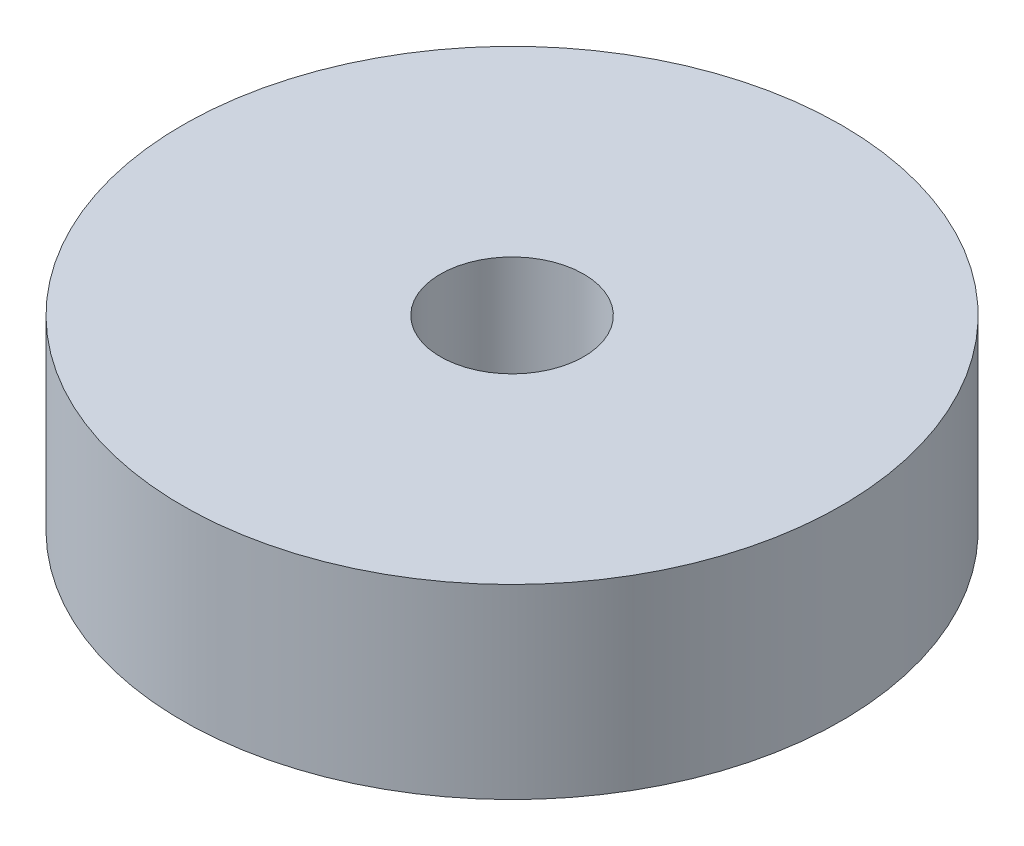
from build123d import *

# Parameters (mm, degrees)
SKETCH1_R           = 46
SKETCH1_R_2         = 10
BOSS_EXTRUDE1_DEPTH = 26


with BuildPart() as part:
    # Sketch1 → Boss-Extrude1 (new body)
    with BuildSketch(Plane(origin=(0, 0, 0), x_dir=(1, 0, 0), z_dir=(0, 1, 0))):
        with Locations(Location((0, 0, 0), (0, 0, 90))):
            Circle(SKETCH1_R)
        with Locations(Location((0, 0, 0), (0, 0, 90))):
            Circle(SKETCH1_R_2, mode=Mode.SUBTRACT)
    extrude(amount=BOSS_EXTRUDE1_DEPTH)


solid = part.part
